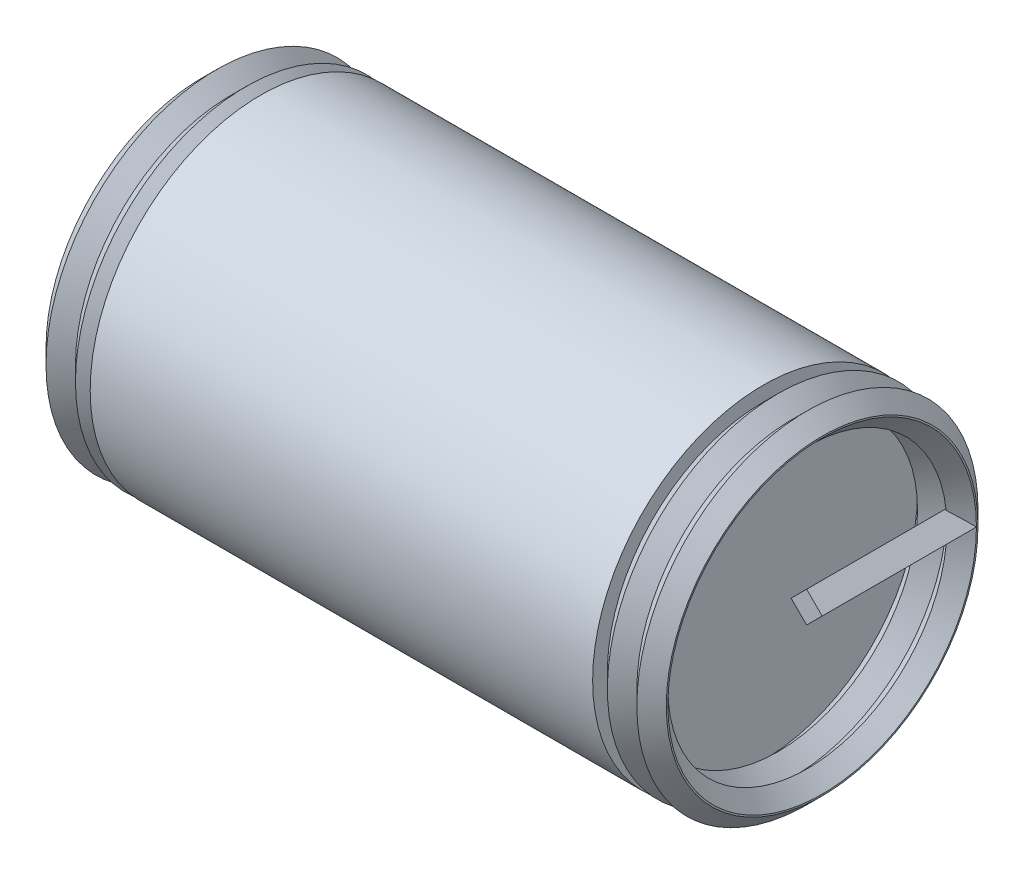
ISO-10303-21;
HEADER;
FILE_DESCRIPTION(('STEP AP214'),'2;1');
FILE_NAME('part.step','',(''),(''),'','','');
FILE_SCHEMA(('AUTOMOTIVE_DESIGN { 1 0 10303 214 1 1 1 1 }'));
ENDSEC;
DATA;
#1=APPLICATION_CONTEXT('core data for automotive mechanical design processes');
#2=APPLICATION_PROTOCOL_DEFINITION('international standard','automotive_design',2000,#1);
#3=PRODUCT_CONTEXT('',#1,'mechanical');
#4=PRODUCT('Part','Part','',(#3));
#5=PRODUCT_RELATED_PRODUCT_CATEGORY('part','',(#4));
#6=PRODUCT_DEFINITION_FORMATION('','',#4);
#7=PRODUCT_DEFINITION_CONTEXT('part definition',#1,'design');
#8=PRODUCT_DEFINITION('design','',#6,#7);
#9=PRODUCT_DEFINITION_SHAPE('','',#8);
#10=(LENGTH_UNIT() NAMED_UNIT(*) SI_UNIT(.MILLI.,.METRE.));
#11=(NAMED_UNIT(*) PLANE_ANGLE_UNIT() SI_UNIT($,.RADIAN.));
#12=(NAMED_UNIT(*) SI_UNIT($,.STERADIAN.) SOLID_ANGLE_UNIT());
#13=UNCERTAINTY_MEASURE_WITH_UNIT(LENGTH_MEASURE(1.E-05),#10,'distance_accuracy_value','');
#14=(GEOMETRIC_REPRESENTATION_CONTEXT(3) GLOBAL_UNCERTAINTY_ASSIGNED_CONTEXT((#13)) GLOBAL_UNIT_ASSIGNED_CONTEXT((#10,
#11,#12)) REPRESENTATION_CONTEXT('',''));
#15=CARTESIAN_POINT('',(0.,0.,0.));
#16=DIRECTION('',(0.,0.,1.));
#17=DIRECTION('',(1.,0.,0.));
#18=AXIS2_PLACEMENT_3D('',#15,#16,#17);
#19=CARTESIAN_POINT('',(0.2,0.,0.));
#20=DIRECTION('',(-0.707106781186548,0.707106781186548,0.));
#21=DIRECTION('',(-0.707106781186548,-0.707106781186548,0.));
#22=AXIS2_PLACEMENT_3D('',#19,#20,#21);
#23=PLANE('',#22);
#24=DIRECTION('',(-0.707106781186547,-0.707106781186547,0.));
#25=VECTOR('',#24,1.);
#26=CARTESIAN_POINT('',(0.4,0.2,0.));
#27=LINE('',#26,#25);
#28=CARTESIAN_POINT('',(0.4,0.2,0.));
#29=VERTEX_POINT('',#28);
#30=CARTESIAN_POINT('',(0.2,0.,0.));
#31=VERTEX_POINT('',#30);
#32=EDGE_CURVE('E132',#29,#31,#27,.T.);
#33=ORIENTED_EDGE('',*,*,#32,.T.);
#34=DIRECTION('',(0.,0.,1.));
#35=VECTOR('',#34,1.);
#36=CARTESIAN_POINT('',(0.2,0.,0.));
#37=LINE('',#36,#35);
#38=CARTESIAN_POINT('',(0.200000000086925,0.,1.81000000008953));
#39=VERTEX_POINT('',#38);
#40=EDGE_CURVE('E130',#39,#31,#37,.F.);
#41=ORIENTED_EDGE('',*,*,#40,.F.);
#42=CARTESIAN_POINT('',(0.200000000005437,2.31766187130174E-11,1.80999999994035));
#43=CARTESIAN_POINT('',(0.229574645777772,0.0295746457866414,1.8395320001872));
#44=CARTESIAN_POINT('',(0.259362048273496,0.0593620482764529,1.86861828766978));
#45=CARTESIAN_POINT('',(0.319362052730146,0.11936205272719,1.92589913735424));
#46=CARTESIAN_POINT('',(0.349574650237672,0.149574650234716,1.95409370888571));
#47=CARTESIAN_POINT('',(0.380000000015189,0.180000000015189,1.98184257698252));
#48=B_SPLINE_CURVE_WITH_KNOTS('',3,(#42,#43,#44,#45,#46,#47),.UNSPECIFIED.,.F.,.F.,(4,2,4),(0.,
0.153575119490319,0.307148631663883),.UNSPECIFIED.);
#49=CARTESIAN_POINT('',(0.380000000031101,0.1800000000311,1.98184257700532));
#50=VERTEX_POINT('',#49);
#51=EDGE_CURVE('E20',#39,#50,#48,.T.);
#52=ORIENTED_EDGE('',*,*,#51,.T.);
#53=CARTESIAN_POINT('',(0.379999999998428,0.179999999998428,1.98184257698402));
#54=CARTESIAN_POINT('',(0.383340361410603,0.183340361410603,1.97818515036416));
#55=CARTESIAN_POINT('',(0.386677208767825,0.186677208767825,1.97452134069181));
#56=CARTESIAN_POINT('',(0.393343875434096,0.193343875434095,1.96718095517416));
#57=CARTESIAN_POINT('',(0.396673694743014,0.196673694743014,1.96350437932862));
#58=CARTESIAN_POINT('',(0.399999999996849,0.199999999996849,1.95982142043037));
#59=B_SPLINE_CURVE_WITH_KNOTS('',3,(#53,#54,#55,#56,#57,#58),.UNSPECIFIED.,.F.,.F.,(4,2,4),(0.,
0.017922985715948,0.035845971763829),.UNSPECIFIED.);
#60=CARTESIAN_POINT('',(0.399999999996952,0.199999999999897,1.95982142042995));
#61=VERTEX_POINT('',#60);
#62=EDGE_CURVE('E128',#50,#61,#59,.T.);
#63=ORIENTED_EDGE('',*,*,#62,.T.);
#64=DIRECTION('',(0.,0.,1.));
#65=VECTOR('',#64,1.);
#66=CARTESIAN_POINT('',(0.4,0.2,0.));
#67=LINE('',#66,#65);
#68=EDGE_CURVE('E411',#29,#61,#67,.T.);
#69=ORIENTED_EDGE('',*,*,#68,.F.);
#70=EDGE_LOOP('',(#33,#41,#52,#63,#69));
#71=FACE_BOUND('',#70,.T.);
#72=ADVANCED_FACE('F16',(#71),#23,.T.);
#73=CARTESIAN_POINT('',(0.4,-0.2,0.));
#74=DIRECTION('',(-0.707106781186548,-0.707106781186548,0.));
#75=DIRECTION('',(0.707106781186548,-0.707106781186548,0.));
#76=AXIS2_PLACEMENT_3D('',#73,#74,#75);
#77=PLANE('',#76);
#78=DIRECTION('',(0.,0.,1.));
#79=VECTOR('',#78,1.);
#80=CARTESIAN_POINT('',(0.4,-0.2,0.));
#81=LINE('',#80,#79);
#82=CARTESIAN_POINT('',(0.399999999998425,-0.199999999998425,1.95982142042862));
#83=VERTEX_POINT('',#82);
#84=CARTESIAN_POINT('',(0.4,-0.2,0.));
#85=VERTEX_POINT('',#84);
#86=EDGE_CURVE('E231',#83,#85,#81,.F.);
#87=ORIENTED_EDGE('',*,*,#86,.F.);
#88=CARTESIAN_POINT('',(0.399999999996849,-0.199999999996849,1.95982142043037));
#89=CARTESIAN_POINT('',(0.396673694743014,-0.196673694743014,1.96350437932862));
#90=CARTESIAN_POINT('',(0.393343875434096,-0.193343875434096,1.96718095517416));
#91=CARTESIAN_POINT('',(0.386677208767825,-0.186677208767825,1.97452134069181));
#92=CARTESIAN_POINT('',(0.383340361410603,-0.183340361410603,1.97818515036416));
#93=CARTESIAN_POINT('',(0.379999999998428,-0.179999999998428,1.98184257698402));
#94=B_SPLINE_CURVE_WITH_KNOTS('',3,(#88,#89,#90,#91,#92,#93),.UNSPECIFIED.,.F.,.F.,(4,2,4),(0.,
0.017922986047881,0.0358459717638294),.UNSPECIFIED.);
#95=CARTESIAN_POINT('',(0.38000000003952,-0.18000000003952,1.98184257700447));
#96=VERTEX_POINT('',#95);
#97=EDGE_CURVE('E135',#83,#96,#94,.T.);
#98=ORIENTED_EDGE('',*,*,#97,.T.);
#99=CARTESIAN_POINT('',(0.380000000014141,-0.180000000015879,1.98184257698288));
#100=CARTESIAN_POINT('',(0.349574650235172,-0.149574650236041,1.95409370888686));
#101=CARTESIAN_POINT('',(0.31936205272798,-0.11936205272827,1.92589913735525));
#102=CARTESIAN_POINT('',(0.259362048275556,-0.0593620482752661,1.86861828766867));
#103=CARTESIAN_POINT('',(0.229574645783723,-0.029574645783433,1.83953200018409));
#104=CARTESIAN_POINT('',(0.200000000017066,-1.70661947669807E-11,1.80999999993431));
#105=B_SPLINE_CURVE_WITH_KNOTS('',3,(#99,#100,#101,#102,#103,#104),.UNSPECIFIED.,.F.,.F.,(4,2,
4),(0.,0.153573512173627,0.307148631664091),.UNSPECIFIED.);
#106=EDGE_CURVE('E123',#96,#39,#105,.T.);
#107=ORIENTED_EDGE('',*,*,#106,.T.);
#108=ORIENTED_EDGE('',*,*,#40,.T.);
#109=DIRECTION('',(0.707106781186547,-0.707106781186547,0.));
#110=VECTOR('',#109,1.);
#111=CARTESIAN_POINT('',(0.2,0.,0.));
#112=LINE('',#111,#110);
#113=EDGE_CURVE('E187',#31,#85,#112,.T.);
#114=ORIENTED_EDGE('',*,*,#113,.T.);
#115=EDGE_LOOP('',(#87,#98,#107,#108,#114));
#116=FACE_BOUND('',#115,.T.);
#117=ADVANCED_FACE('F139',(#116),#77,.T.);
#118=CARTESIAN_POINT('',(0.4,0.,0.));
#119=DIRECTION('',(0.,0.,1.));
#120=DIRECTION('',(1.,0.,0.));
#121=AXIS2_PLACEMENT_3D('',#118,#119,#120);
#122=PLANE('',#121);
#123=ORIENTED_EDGE('',*,*,#113,.F.);
#124=ORIENTED_EDGE('',*,*,#32,.F.);
#125=DIRECTION('',(-0.707106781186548,0.707106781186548,0.));
#126=VECTOR('',#125,1.);
#127=CARTESIAN_POINT('',(0.4,0.2,0.));
#128=LINE('',#127,#126);
#129=CARTESIAN_POINT('',(0.6,0.,0.));
#130=VERTEX_POINT('',#129);
#131=EDGE_CURVE('E186',#130,#29,#128,.T.);
#132=ORIENTED_EDGE('',*,*,#131,.F.);
#133=DIRECTION('',(0.707106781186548,0.707106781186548,0.));
#134=VECTOR('',#133,1.);
#135=CARTESIAN_POINT('',(0.6,0.,0.));
#136=LINE('',#135,#134);
#137=EDGE_CURVE('E400',#85,#130,#136,.T.);
#138=ORIENTED_EDGE('',*,*,#137,.F.);
#139=EDGE_LOOP('',(#123,#124,#132,#138));
#140=FACE_BOUND('',#139,.T.);
#141=ADVANCED_FACE('F160',(#140),#122,.F.);
#142=CARTESIAN_POINT('',(0.4,0.2,0.));
#143=DIRECTION('',(0.707106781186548,0.707106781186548,0.));
#144=DIRECTION('',(-0.707106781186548,0.707106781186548,0.));
#145=AXIS2_PLACEMENT_3D('',#142,#143,#144);
#146=PLANE('',#145);
#147=ORIENTED_EDGE('',*,*,#68,.T.);
#148=CARTESIAN_POINT('',(0.399999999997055,0.200000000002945,1.95982142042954));
#149=CARTESIAN_POINT('',(0.428703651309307,0.171296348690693,1.93392979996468));
#150=CARTESIAN_POINT('',(0.457222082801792,0.142777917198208,1.9076447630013));
#151=CARTESIAN_POINT('',(0.513888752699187,0.0861112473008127,1.85428762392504));
#152=CARTESIAN_POINT('',(0.542036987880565,0.0579630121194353,1.82721551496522));
#153=CARTESIAN_POINT('',(0.570000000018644,0.0299999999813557,1.79974998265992));
#154=B_SPLINE_CURVE_WITH_KNOTS('',3,(#148,#149,#150,#151,#152,#153),.UNSPECIFIED.,.F.,.F.,(4,2,
4),(0.,0.144421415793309,0.28884408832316),.UNSPECIFIED.);
#155=CARTESIAN_POINT('',(0.570000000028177,0.0299999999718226,1.79974998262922));
#156=VERTEX_POINT('',#155);
#157=EDGE_CURVE('E176',#61,#156,#154,.T.);
#158=ORIENTED_EDGE('',*,*,#157,.T.);
#159=CARTESIAN_POINT('',(0.570000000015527,0.0299999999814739,1.7997499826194));
#160=CARTESIAN_POINT('',(0.57498595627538,0.0250140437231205,1.80481950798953));
#161=CARTESIAN_POINT('',(0.579978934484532,0.020021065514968,1.80987510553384));
#162=CARTESIAN_POINT('',(0.58997893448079,0.0100210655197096,1.81995844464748));
#163=CARTESIAN_POINT('',(0.594985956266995,0.00501404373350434,1.82498618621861));
#164=CARTESIAN_POINT('',(0.600000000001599,-1.59941669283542E-12,1.82999999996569));
#165=B_SPLINE_CURVE_WITH_KNOTS('',3,(#159,#160,#161,#162,#163,#164),.UNSPECIFIED.,.F.,.F.,(4,2,
4),(0.,0.0260531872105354,0.0521063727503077),.UNSPECIFIED.);
#166=CARTESIAN_POINT('',(0.599999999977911,1.35304092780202E-12,1.82999999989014));
#167=VERTEX_POINT('',#166);
#168=EDGE_CURVE('E181',#156,#167,#165,.T.);
#169=ORIENTED_EDGE('',*,*,#168,.T.);
#170=DIRECTION('',(0.,0.,1.));
#171=VECTOR('',#170,1.);
#172=CARTESIAN_POINT('',(0.6,0.,0.));
#173=LINE('',#172,#171);
#174=EDGE_CURVE('E397',#130,#167,#173,.T.);
#175=ORIENTED_EDGE('',*,*,#174,.F.);
#176=ORIENTED_EDGE('',*,*,#131,.T.);
#177=EDGE_LOOP('',(#147,#158,#169,#175,#176));
#178=FACE_BOUND('',#177,.T.);
#179=ADVANCED_FACE('F165',(#178),#146,.T.);
#180=CARTESIAN_POINT('',(8.,0.,0.));
#181=DIRECTION('',(0.707106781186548,0.707106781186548,0.));
#182=DIRECTION('',(-0.707106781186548,0.707106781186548,0.));
#183=AXIS2_PLACEMENT_3D('',#180,#181,#182);
#184=PLANE('',#183);
#185=DIRECTION('',(0.707106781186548,-0.707106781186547,0.));
#186=VECTOR('',#185,1.);
#187=CARTESIAN_POINT('',(7.8,0.2,0.));
#188=LINE('',#187,#186);
#189=CARTESIAN_POINT('',(7.8,0.2,0.));
#190=VERTEX_POINT('',#189);
#191=CARTESIAN_POINT('',(8.,0.,0.));
#192=VERTEX_POINT('',#191);
#193=EDGE_CURVE('E390',#190,#192,#188,.T.);
#194=ORIENTED_EDGE('',*,*,#193,.T.);
#195=DIRECTION('',(0.,0.,1.));
#196=VECTOR('',#195,1.);
#197=CARTESIAN_POINT('',(8.,0.,0.));
#198=LINE('',#197,#196);
#199=CARTESIAN_POINT('',(7.99999999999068,-9.32247447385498E-12,-1.98999999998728));
#200=VERTEX_POINT('',#199);
#201=EDGE_CURVE('E295',#200,#192,#198,.T.);
#202=ORIENTED_EDGE('',*,*,#201,.F.);
#203=CARTESIAN_POINT('',(7.99999999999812,1.87948845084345E-12,-1.98999999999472));
#204=CARTESIAN_POINT('',(7.98387979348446,0.0161202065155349,-1.97387955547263));
#205=CARTESIAN_POINT('',(7.96782460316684,0.0321753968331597,-1.95762872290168));
#206=CARTESIAN_POINT('',(7.9358562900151,0.0641437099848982,-1.92485758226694));
#207=CARTESIAN_POINT('',(7.91994314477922,0.0800568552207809,-1.90833731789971));
#208=CARTESIAN_POINT('',(7.88826545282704,0.111734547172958,-1.87501310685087));
#209=CARTESIAN_POINT('',(7.87250090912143,0.12749909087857,-1.85820915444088));
#210=CARTESIAN_POINT('',(7.84112910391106,0.158870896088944,-1.82430288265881));
#211=CARTESIAN_POINT('',(7.82552186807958,0.174478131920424,-1.80720051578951));
#212=CARTESIAN_POINT('',(7.81000000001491,0.189999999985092,-1.78994413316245));
#213=B_SPLINE_CURVE_WITH_KNOTS('',3,(#203,#204,#205,#206,#207,#208,#209,#210,#211,#212),
.UNSPECIFIED.,.F.,.F.,(4,2,2,2,4),(0.,0.0837633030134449,0.167513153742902,0.25126469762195,
0.335029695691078),.UNSPECIFIED.);
#214=CARTESIAN_POINT('',(7.8099999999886,0.190000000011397,-1.78994413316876));
#215=VERTEX_POINT('',#214);
#216=EDGE_CURVE('E528',#200,#215,#213,.T.);
#217=ORIENTED_EDGE('',*,*,#216,.T.);
#218=CARTESIAN_POINT('',(7.80999999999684,0.190000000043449,-1.78994413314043));
#219=CARTESIAN_POINT('',(7.80833452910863,0.191665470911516,-1.7914421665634));
#220=CARTESIAN_POINT('',(7.80666846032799,0.19333153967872,-1.79293886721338));
#221=CARTESIAN_POINT('',(7.80333512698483,0.19666487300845,-1.79592960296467));
#222=CARTESIAN_POINT('',(7.80166786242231,0.198332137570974,-1.797423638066));
#223=CARTESIAN_POINT('',(7.79999999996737,0.200000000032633,-1.79891634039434));
#224=B_SPLINE_CURVE_WITH_KNOTS('',3,(#218,#219,#220,#221,#222,#223),.UNSPECIFIED.,.F.,.F.,(4,2,
4),(0.,0.00837407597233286,0.0167481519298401),.UNSPECIFIED.);
#225=CARTESIAN_POINT('',(7.79999999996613,0.199999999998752,-1.79891634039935));
#226=VERTEX_POINT('',#225);
#227=EDGE_CURVE('E232',#215,#226,#224,.T.);
#228=ORIENTED_EDGE('',*,*,#227,.T.);
#229=DIRECTION('',(0.,0.,1.));
#230=VECTOR('',#229,1.);
#231=CARTESIAN_POINT('',(7.8,0.2,0.));
#232=LINE('',#231,#230);
#233=EDGE_CURVE('E382',#190,#226,#232,.F.);
#234=ORIENTED_EDGE('',*,*,#233,.F.);
#235=EDGE_LOOP('',(#194,#202,#217,#228,#234));
#236=FACE_BOUND('',#235,.T.);
#237=ADVANCED_FACE('F170',(#236),#184,.T.);
#238=CARTESIAN_POINT('',(0.6,0.,0.));
#239=DIRECTION('',(0.707106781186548,-0.707106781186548,0.));
#240=DIRECTION('',(0.707106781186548,0.707106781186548,0.));
#241=AXIS2_PLACEMENT_3D('',#238,#239,#240);
#242=PLANE('',#241);
#243=ORIENTED_EDGE('',*,*,#137,.T.);
#244=ORIENTED_EDGE('',*,*,#174,.T.);
#245=CARTESIAN_POINT('',(0.570000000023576,-0.0299999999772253,1.79974998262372));
#246=CARTESIAN_POINT('',(0.574985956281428,-0.0250140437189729,1.80481950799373));
#247=CARTESIAN_POINT('',(0.579978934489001,-0.0200210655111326,1.80987510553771));
#248=CARTESIAN_POINT('',(0.589978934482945,-0.0100210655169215,1.81995844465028));
#249=CARTESIAN_POINT('',(0.594985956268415,-0.00501404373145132,1.82498618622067));
#250=CARTESIAN_POINT('',(0.600000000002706,2.70607760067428E-12,1.8299999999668));
#251=B_SPLINE_CURVE_WITH_KNOTS('',3,(#245,#246,#247,#248,#249,#250),.UNSPECIFIED.,.F.,.F.,(4,2,
4),(0.,0.0260531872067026,0.052106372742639),.UNSPECIFIED.);
#252=CARTESIAN_POINT('',(0.570000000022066,-0.0299999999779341,1.79974998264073));
#253=VERTEX_POINT('',#252);
#254=EDGE_CURVE('E201',#253,#167,#251,.T.);
#255=ORIENTED_EDGE('',*,*,#254,.F.);
#256=CARTESIAN_POINT('',(0.570000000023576,-0.0299999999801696,1.79974998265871));
#257=CARTESIAN_POINT('',(0.542036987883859,-0.0579630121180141,1.8272155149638));
#258=CARTESIAN_POINT('',(0.513888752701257,-0.0861112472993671,1.85428762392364));
#259=CARTESIAN_POINT('',(0.457222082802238,-0.142777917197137,1.90764476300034));
#260=CARTESIAN_POINT('',(0.428703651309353,-0.171296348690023,1.93392979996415));
#261=CARTESIAN_POINT('',(0.399999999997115,-0.200000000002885,1.95982142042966));
#262=B_SPLINE_CURVE_WITH_KNOTS('',3,(#256,#257,#258,#259,#260,#261),.UNSPECIFIED.,.F.,.F.,(4,2,
4),(0.,0.144422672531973,0.288844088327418),.UNSPECIFIED.);
#263=EDGE_CURVE('E224',#253,#83,#262,.T.);
#264=ORIENTED_EDGE('',*,*,#263,.T.);
#265=ORIENTED_EDGE('',*,*,#86,.T.);
#266=EDGE_LOOP('',(#243,#244,#255,#264,#265));
#267=FACE_BOUND('',#266,.T.);
#268=ADVANCED_FACE('F215',(#267),#242,.T.);
#269=CARTESIAN_POINT('',(0.76,0.,0.));
#270=DIRECTION('',(-1.,0.,0.));
#271=DIRECTION('',(0.,0.,1.));
#272=AXIS2_PLACEMENT_3D('',#269,#270,#271);
#273=PLANE('',#272);
#274=CARTESIAN_POINT('',(0.759999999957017,0.,0.));
#275=DIRECTION('',(1.,0.,0.));
#276=DIRECTION('',(0.,0.,-1.));
#277=AXIS2_PLACEMENT_3D('',#274,#275,#276);
#278=CIRCLE('',#277,1.98999999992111);
#279=CARTESIAN_POINT('',(0.759999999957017,0.,-1.98999999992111));
#280=VERTEX_POINT('',#279);
#281=EDGE_CURVE('E208',#280,#280,#278,.T.);
#282=ORIENTED_EDGE('',*,*,#281,.F.);
#283=EDGE_LOOP('',(#282));
#284=FACE_BOUND('',#283,.T.);
#285=ADVANCED_FACE('F219',(#284),#273,.T.);
#286=CARTESIAN_POINT('',(7.8,-0.2,0.));
#287=DIRECTION('',(0.707106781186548,-0.707106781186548,0.));
#288=DIRECTION('',(0.707106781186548,0.707106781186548,0.));
#289=AXIS2_PLACEMENT_3D('',#286,#287,#288);
#290=PLANE('',#289);
#291=DIRECTION('',(0.,0.,1.));
#292=VECTOR('',#291,1.);
#293=CARTESIAN_POINT('',(7.8,-0.2,0.));
#294=LINE('',#293,#292);
#295=CARTESIAN_POINT('',(7.79999999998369,-0.200000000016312,-1.79891634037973));
#296=VERTEX_POINT('',#295);
#297=CARTESIAN_POINT('',(7.8,-0.2,0.));
#298=VERTEX_POINT('',#297);
#299=EDGE_CURVE('E279',#296,#298,#294,.T.);
#300=ORIENTED_EDGE('',*,*,#299,.F.);
#301=CARTESIAN_POINT('',(7.7999999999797,-0.200000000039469,-1.79891634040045));
#302=CARTESIAN_POINT('',(7.80166786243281,-0.19833213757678,-1.79742363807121));
#303=CARTESIAN_POINT('',(7.80333512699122,-0.196664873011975,-1.79592960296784));
#304=CARTESIAN_POINT('',(7.80666846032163,-0.193331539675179,-1.79293886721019));
#305=CARTESIAN_POINT('',(7.80833452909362,-0.191665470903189,-1.79144216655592));
#306=CARTESIAN_POINT('',(7.80999999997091,-0.190000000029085,-1.78994413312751));
#307=B_SPLINE_CURVE_WITH_KNOTS('',3,(#301,#302,#303,#304,#305,#306),.UNSPECIFIED.,.F.,.F.,(4,2,
4),(0.,0.00837407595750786,0.0167481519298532),.UNSPECIFIED.);
#308=CARTESIAN_POINT('',(7.81000000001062,-0.18999999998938,-1.7899441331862));
#309=VERTEX_POINT('',#308);
#310=EDGE_CURVE('E288',#296,#309,#307,.T.);
#311=ORIENTED_EDGE('',*,*,#310,.T.);
#312=CARTESIAN_POINT('',(7.81000000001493,-0.189999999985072,-1.78994413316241));
#313=CARTESIAN_POINT('',(7.82552186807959,-0.174478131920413,-1.80720051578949));
#314=CARTESIAN_POINT('',(7.84112910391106,-0.158870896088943,-1.8243028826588));
#315=CARTESIAN_POINT('',(7.87250090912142,-0.127499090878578,-1.85820915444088));
#316=CARTESIAN_POINT('',(7.88826545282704,-0.111734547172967,-1.87501310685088));
#317=CARTESIAN_POINT('',(7.91994314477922,-0.0800568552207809,-1.9083373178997));
#318=CARTESIAN_POINT('',(7.93585629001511,-0.064143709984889,-1.9248575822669));
#319=CARTESIAN_POINT('',(7.96782460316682,-0.0321753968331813,-1.95762872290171));
#320=CARTESIAN_POINT('',(7.9838797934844,-0.0161202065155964,-1.97387955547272));
#321=CARTESIAN_POINT('',(7.99999999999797,-2.03499376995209E-12,-1.989999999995));
#322=B_SPLINE_CURVE_WITH_KNOTS('',3,(#312,#313,#314,#315,#316,#317,#318,#319,#320,#321),
.UNSPECIFIED.,.F.,.F.,(4,2,2,2,4),(0.,0.083764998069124,0.167516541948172,0.251266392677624,
0.335029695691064),.UNSPECIFIED.);
#323=EDGE_CURVE('E233',#309,#200,#322,.T.);
#324=ORIENTED_EDGE('',*,*,#323,.T.);
#325=ORIENTED_EDGE('',*,*,#201,.T.);
#326=DIRECTION('',(-0.707106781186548,-0.707106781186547,0.));
#327=VECTOR('',#326,1.);
#328=CARTESIAN_POINT('',(8.,0.,0.));
#329=LINE('',#328,#327);
#330=EDGE_CURVE('E294',#192,#298,#329,.T.);
#331=ORIENTED_EDGE('',*,*,#330,.T.);
#332=EDGE_LOOP('',(#300,#311,#324,#325,#331));
#333=FACE_BOUND('',#332,.T.);
#334=ADVANCED_FACE('F296',(#333),#290,.T.);
#335=CARTESIAN_POINT('',(7.8,0.,0.));
#336=DIRECTION('',(0.,0.,-1.));
#337=DIRECTION('',(0.,1.,0.));
#338=AXIS2_PLACEMENT_3D('',#335,#336,#337);
#339=PLANE('',#338);
#340=DIRECTION('',(-0.707106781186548,-0.707106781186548,0.));
#341=VECTOR('',#340,1.);
#342=CARTESIAN_POINT('',(7.8,0.2,0.));
#343=LINE('',#342,#341);
#344=CARTESIAN_POINT('',(7.6,0.,0.));
#345=VERTEX_POINT('',#344);
#346=EDGE_CURVE('E379',#345,#190,#343,.F.);
#347=ORIENTED_EDGE('',*,*,#346,.F.);
#348=DIRECTION('',(0.707106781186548,-0.707106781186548,0.));
#349=VECTOR('',#348,1.);
#350=CARTESIAN_POINT('',(7.6,0.,0.));
#351=LINE('',#350,#349);
#352=EDGE_CURVE('E374',#298,#345,#351,.F.);
#353=ORIENTED_EDGE('',*,*,#352,.F.);
#354=ORIENTED_EDGE('',*,*,#330,.F.);
#355=ORIENTED_EDGE('',*,*,#193,.F.);
#356=EDGE_LOOP('',(#347,#353,#354,#355));
#357=FACE_BOUND('',#356,.T.);
#358=ADVANCED_FACE('F300',(#357),#339,.F.);
#359=CARTESIAN_POINT('',(7.8,0.2,0.));
#360=DIRECTION('',(-0.707106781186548,0.707106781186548,0.));
#361=DIRECTION('',(-0.707106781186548,-0.707106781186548,0.));
#362=AXIS2_PLACEMENT_3D('',#359,#360,#361);
#363=PLANE('',#362);
#364=ORIENTED_EDGE('',*,*,#233,.T.);
#365=CARTESIAN_POINT('',(7.7999999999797,0.199999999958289,-1.79891634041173));
#366=CARTESIAN_POINT('',(7.78528301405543,0.185283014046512,-1.81535972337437));
#367=CARTESIAN_POINT('',(7.77048903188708,0.170489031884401,-1.83166453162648));
#368=CARTESIAN_POINT('',(7.74075809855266,0.140758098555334,-1.86400497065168));
#369=CARTESIAN_POINT('',(7.72582116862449,0.125821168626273,-1.88004064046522));
#370=CARTESIAN_POINT('',(7.6808048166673,0.0808048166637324,-1.92776429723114));
#371=CARTESIAN_POINT('',(7.65052098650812,0.0505209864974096,-1.95906764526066));
#372=CARTESIAN_POINT('',(7.61999999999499,0.0199999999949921,-1.98989949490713));
#373=B_SPLINE_CURVE_WITH_KNOTS('',3,(#365,#366,#367,#368,#369,#370,#371,#372),.UNSPECIFIED.,.F.,
.F.,(4,2,2,4),(0.,0.0795729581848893,0.159134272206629,0.318263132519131),.UNSPECIFIED.);
#374=CARTESIAN_POINT('',(7.62000000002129,0.0200000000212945,-1.98989949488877));
#375=VERTEX_POINT('',#374);
#376=EDGE_CURVE('E209',#226,#375,#373,.T.);
#377=ORIENTED_EDGE('',*,*,#376,.T.);
#378=CARTESIAN_POINT('',(7.62000000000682,0.0200000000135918,-1.98989949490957));
#379=CARTESIAN_POINT('',(7.61666112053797,0.0166611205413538,-1.98659406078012));
#380=CARTESIAN_POINT('',(7.61332501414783,0.0133250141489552,-1.98328305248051));
#381=CARTESIAN_POINT('',(7.60665834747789,0.0066583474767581,-1.97664988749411));
#382=CARTESIAN_POINT('',(7.60332778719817,0.00332778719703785,-1.97332773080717));
#383=CARTESIAN_POINT('',(7.59999999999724,-2.76459286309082E-12,-1.9699999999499));
#384=B_SPLINE_CURVE_WITH_KNOTS('',3,(#378,#379,#380,#381,#382,#383),.UNSPECIFIED.,.F.,.F.,(4,2,
4),(0.,0.0172915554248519,0.0345831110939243),.UNSPECIFIED.);
#385=CARTESIAN_POINT('',(7.59999999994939,0.,-1.96999999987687));
#386=VERTEX_POINT('',#385);
#387=EDGE_CURVE('E255',#375,#386,#384,.T.);
#388=ORIENTED_EDGE('',*,*,#387,.T.);
#389=DIRECTION('',(0.,0.,1.));
#390=VECTOR('',#389,1.);
#391=CARTESIAN_POINT('',(7.6,0.,0.));
#392=LINE('',#391,#390);
#393=EDGE_CURVE('E273',#345,#386,#392,.F.);
#394=ORIENTED_EDGE('',*,*,#393,.F.);
#395=ORIENTED_EDGE('',*,*,#346,.T.);
#396=EDGE_LOOP('',(#364,#377,#388,#394,#395));
#397=FACE_BOUND('',#396,.T.);
#398=ADVANCED_FACE('F304',(#397),#363,.T.);
#399=CARTESIAN_POINT('',(7.24,0.,0.));
#400=DIRECTION('',(1.,0.,0.));
#401=DIRECTION('',(0.,1.,0.));
#402=AXIS2_PLACEMENT_3D('',#399,#400,#401);
#403=PLANE('',#402);
#404=CARTESIAN_POINT('',(7.23999999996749,0.,0.));
#405=DIRECTION('',(-1.,0.,0.));
#406=DIRECTION('',(0.,0.,1.));
#407=AXIS2_PLACEMENT_3D('',#404,#405,#406);
#408=CIRCLE('',#407,1.9900000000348);
#409=CARTESIAN_POINT('',(7.23999999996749,0.,1.9900000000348));
#410=VERTEX_POINT('',#409);
#411=EDGE_CURVE('E271',#410,#410,#408,.T.);
#412=ORIENTED_EDGE('',*,*,#411,.F.);
#413=EDGE_LOOP('',(#412));
#414=FACE_BOUND('',#413,.T.);
#415=ADVANCED_FACE('F194',(#414),#403,.T.);
#416=CARTESIAN_POINT('',(0.569999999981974,0.,0.));
#417=DIRECTION('',(1.,0.,0.));
#418=DIRECTION('',(0.,0.,-1.));
#419=AXIS2_PLACEMENT_3D('',#416,#417,#418);
#420=CONICAL_SURFACE('',#419,1.79999999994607,0.785398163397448);
#421=ORIENTED_EDGE('',*,*,#281,.T.);
#422=EDGE_LOOP('',(#421));
#423=FACE_BOUND('',#422,.T.);
#424=ORIENTED_EDGE('',*,*,#168,.F.);
#425=CARTESIAN_POINT('',(0.570000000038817,0.,0.));
#426=DIRECTION('',(-1.,0.,0.));
#427=DIRECTION('',(0.,0.,-1.));
#428=AXIS2_PLACEMENT_3D('',#425,#426,#427);
#429=CIRCLE('',#428,1.80000000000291);
#430=EDGE_CURVE('E268',#253,#156,#429,.F.);
#431=ORIENTED_EDGE('',*,*,#430,.F.);
#432=ORIENTED_EDGE('',*,*,#254,.T.);
#433=EDGE_LOOP('',(#424,#431,#432));
#434=FACE_BOUND('',#433,.T.);
#435=ADVANCED_FACE('F188',(#423,#434),#420,.F.);
#436=CARTESIAN_POINT('',(7.6,0.,0.));
#437=DIRECTION('',(-0.707106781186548,-0.707106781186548,0.));
#438=DIRECTION('',(0.707106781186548,-0.707106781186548,0.));
#439=AXIS2_PLACEMENT_3D('',#436,#437,#438);
#440=PLANE('',#439);
#441=ORIENTED_EDGE('',*,*,#352,.T.);
#442=ORIENTED_EDGE('',*,*,#393,.T.);
#443=CARTESIAN_POINT('',(7.62000000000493,-0.0200000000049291,-1.98989949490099));
#444=CARTESIAN_POINT('',(7.6166611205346,-0.0166611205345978,-1.98659406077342));
#445=CARTESIAN_POINT('',(7.61332501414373,-0.0133250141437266,-1.98328305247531));
#446=CARTESIAN_POINT('',(7.60665834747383,-0.00665834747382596,-1.97664988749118));
#447=CARTESIAN_POINT('',(7.60332778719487,-0.00332778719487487,-1.973327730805));
#448=CARTESIAN_POINT('',(7.59999999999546,4.53784623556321E-12,-1.96999999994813));
#449=B_SPLINE_CURVE_WITH_KNOTS('',3,(#443,#444,#445,#446,#447,#448),.UNSPECIFIED.,.F.,.F.,(4,2,
4),(0.,0.0172915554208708,0.0345831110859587),.UNSPECIFIED.);
#450=CARTESIAN_POINT('',(7.6199999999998,-0.0199999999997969,-1.98989949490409));
#451=VERTEX_POINT('',#450);
#452=EDGE_CURVE('E260',#451,#386,#449,.T.);
#453=ORIENTED_EDGE('',*,*,#452,.F.);
#454=CARTESIAN_POINT('',(7.61999999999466,-0.0199999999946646,-1.9898994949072));
#455=CARTESIAN_POINT('',(7.65052098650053,-0.0505209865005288,-1.9590676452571));
#456=CARTESIAN_POINT('',(7.68080481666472,-0.0808048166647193,-1.92776429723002));
#457=CARTESIAN_POINT('',(7.72582116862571,-0.125821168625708,-1.88004064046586));
#458=CARTESIAN_POINT('',(7.74075809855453,-0.140758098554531,-1.86400497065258));
#459=CARTESIAN_POINT('',(7.77048903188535,-0.170489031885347,-1.83166453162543));
#460=CARTESIAN_POINT('',(7.78528301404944,-0.185283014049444,-1.81535972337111));
#461=CARTESIAN_POINT('',(7.79999999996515,-0.199999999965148,-1.79891634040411));
#462=B_SPLINE_CURVE_WITH_KNOTS('',3,(#454,#455,#456,#457,#458,#459,#460,#461),.UNSPECIFIED.,.F.,
.F.,(4,2,2,4),(0.,0.159128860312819,0.238690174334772,0.318263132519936),.UNSPECIFIED.);
#463=EDGE_CURVE('E274',#451,#296,#462,.T.);
#464=ORIENTED_EDGE('',*,*,#463,.T.);
#465=ORIENTED_EDGE('',*,*,#299,.T.);
#466=EDGE_LOOP('',(#441,#442,#453,#464,#465));
#467=FACE_BOUND('',#466,.T.);
#468=ADVANCED_FACE('F193',(#467),#440,.T.);
#469=CARTESIAN_POINT('',(7.42999999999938,0.,0.));
#470=DIRECTION('',(-1.,0.,0.));
#471=DIRECTION('',(0.,0.,1.));
#472=AXIS2_PLACEMENT_3D('',#469,#470,#471);
#473=CONICAL_SURFACE('',#472,1.80000000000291,0.785398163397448);
#474=CARTESIAN_POINT('',(7.42999999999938,0.,0.));
#475=DIRECTION('',(1.,0.,0.));
#476=DIRECTION('',(0.,0.,-1.));
#477=AXIS2_PLACEMENT_3D('',#474,#475,#476);
#478=CIRCLE('',#477,1.80000000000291);
#479=CARTESIAN_POINT('',(7.42999999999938,0.,-1.80000000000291));
#480=VERTEX_POINT('',#479);
#481=EDGE_CURVE('E267',#480,#480,#478,.F.);
#482=ORIENTED_EDGE('',*,*,#481,.F.);
#483=EDGE_LOOP('',(#482));
#484=FACE_BOUND('',#483,.T.);
#485=ORIENTED_EDGE('',*,*,#411,.T.);
#486=EDGE_LOOP('',(#485));
#487=FACE_BOUND('',#486,.T.);
#488=ADVANCED_FACE('F246',(#484,#487),#473,.F.);
#489=CARTESIAN_POINT('',(0.570000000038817,0.,0.));
#490=DIRECTION('',(-1.,0.,0.));
#491=DIRECTION('',(0.,0.,1.));
#492=AXIS2_PLACEMENT_3D('',#489,#490,#491);
#493=CONICAL_SURFACE('',#492,1.80000000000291,0.78539816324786);
#494=CARTESIAN_POINT('',(0.380000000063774,0.,0.));
#495=DIRECTION('',(1.,0.,0.));
#496=DIRECTION('',(0.,0.,-1.));
#497=AXIS2_PLACEMENT_3D('',#494,#495,#496);
#498=CIRCLE('',#497,1.9900000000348);
#499=EDGE_CURVE('E125',#96,#50,#498,.T.);
#500=ORIENTED_EDGE('',*,*,#499,.F.);
#501=ORIENTED_EDGE('',*,*,#97,.F.);
#502=ORIENTED_EDGE('',*,*,#263,.F.);
#503=ORIENTED_EDGE('',*,*,#430,.T.);
#504=ORIENTED_EDGE('',*,*,#157,.F.);
#505=ORIENTED_EDGE('',*,*,#62,.F.);
#506=EDGE_LOOP('',(#500,#501,#502,#503,#504,#505));
#507=FACE_BOUND('',#506,.T.);
#508=ADVANCED_FACE('F242',(#507),#493,.F.);
#509=CARTESIAN_POINT('',(7.42999999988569,0.,0.));
#510=DIRECTION('',(1.,0.,0.));
#511=DIRECTION('',(0.,1.,0.));
#512=AXIS2_PLACEMENT_3D('',#509,#510,#511);
#513=CONICAL_SURFACE('',#512,1.79999999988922,0.78539816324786);
#514=ORIENTED_EDGE('',*,*,#452,.T.);
#515=ORIENTED_EDGE('',*,*,#387,.F.);
#516=CARTESIAN_POINT('',(7.62000000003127,0.,0.));
#517=DIRECTION('',(-1.,0.,0.));
#518=DIRECTION('',(0.,0.,-1.));
#519=AXIS2_PLACEMENT_3D('',#516,#517,#518);
#520=CIRCLE('',#519,1.98999999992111);
#521=EDGE_CURVE('E361',#451,#375,#520,.T.);
#522=ORIENTED_EDGE('',*,*,#521,.F.);
#523=EDGE_LOOP('',(#514,#515,#522));
#524=FACE_BOUND('',#523,.T.);
#525=ORIENTED_EDGE('',*,*,#481,.T.);
#526=EDGE_LOOP('',(#525));
#527=FACE_BOUND('',#526,.T.);
#528=ADVANCED_FACE('F245',(#524,#527),#513,.F.);
#529=CARTESIAN_POINT('',(0.1899999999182,0.,0.));
#530=DIRECTION('',(1.,0.,0.));
#531=DIRECTION('',(0.,0.,-1.));
#532=AXIS2_PLACEMENT_3D('',#529,#530,#531);
#533=CONICAL_SURFACE('',#532,1.79999999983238,0.785398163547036);
#534=CARTESIAN_POINT('',(0.189999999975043,0.,0.));
#535=DIRECTION('',(-1.,0.,0.));
#536=DIRECTION('',(0.,0.,-1.));
#537=AXIS2_PLACEMENT_3D('',#534,#535,#536);
#538=CIRCLE('',#537,1.80000000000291);
#539=CARTESIAN_POINT('',(0.189999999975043,0.,-1.80000000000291));
#540=VERTEX_POINT('',#539);
#541=EDGE_CURVE('E355',#540,#540,#538,.F.);
#542=ORIENTED_EDGE('',*,*,#541,.F.);
#543=EDGE_LOOP('',(#542));
#544=FACE_BOUND('',#543,.T.);
#545=ORIENTED_EDGE('',*,*,#106,.F.);
#546=ORIENTED_EDGE('',*,*,#499,.T.);
#547=ORIENTED_EDGE('',*,*,#51,.F.);
#548=EDGE_LOOP('',(#545,#546,#547));
#549=FACE_BOUND('',#548,.T.);
#550=ADVANCED_FACE('F121',(#544,#549),#533,.F.);
#551=CARTESIAN_POINT('',(7.81000000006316,0.,0.));
#552=DIRECTION('',(-1.,0.,0.));
#553=DIRECTION('',(0.,0.,1.));
#554=AXIS2_PLACEMENT_3D('',#551,#552,#553);
#555=CONICAL_SURFACE('',#554,1.79999999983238,0.785398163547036);
#556=ORIENTED_EDGE('',*,*,#521,.T.);
#557=ORIENTED_EDGE('',*,*,#376,.F.);
#558=ORIENTED_EDGE('',*,*,#227,.F.);
#559=CARTESIAN_POINT('',(7.81000000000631,0.,0.));
#560=DIRECTION('',(1.,0.,0.));
#561=DIRECTION('',(0.,0.,-1.));
#562=AXIS2_PLACEMENT_3D('',#559,#560,#561);
#563=CIRCLE('',#562,1.80000000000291);
#564=EDGE_CURVE('E352',#309,#215,#563,.F.);
#565=ORIENTED_EDGE('',*,*,#564,.F.);
#566=ORIENTED_EDGE('',*,*,#310,.F.);
#567=ORIENTED_EDGE('',*,*,#463,.F.);
#568=EDGE_LOOP('',(#556,#557,#558,#565,#566,#567));
#569=FACE_BOUND('',#568,.T.);
#570=ADVANCED_FACE('F280',(#569),#555,.F.);
#571=CARTESIAN_POINT('',(0.190000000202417,0.,0.));
#572=DIRECTION('',(-1.,0.,0.));
#573=DIRECTION('',(0.,0.,1.));
#574=AXIS2_PLACEMENT_3D('',#571,#572,#573);
#575=CONICAL_SURFACE('',#574,1.79999999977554,0.785398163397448);
#576=CARTESIAN_POINT('',(5.68432833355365E-11,0.,0.));
#577=DIRECTION('',(-1.,0.,0.));
#578=DIRECTION('',(0.,0.,1.));
#579=AXIS2_PLACEMENT_3D('',#576,#577,#578);
#580=CIRCLE('',#579,1.98999999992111);
#581=CARTESIAN_POINT('',(5.68431484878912E-11,0.,1.98999999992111));
#582=VERTEX_POINT('',#581);
#583=EDGE_CURVE('E269',#582,#582,#580,.F.);
#584=ORIENTED_EDGE('',*,*,#583,.F.);
#585=EDGE_LOOP('',(#584));
#586=FACE_BOUND('',#585,.T.);
#587=ORIENTED_EDGE('',*,*,#541,.T.);
#588=EDGE_LOOP('',(#587));
#589=FACE_BOUND('',#588,.T.);
#590=ADVANCED_FACE('F284',(#586,#589),#575,.F.);
#591=CARTESIAN_POINT('',(7.80999999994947,0.,0.));
#592=DIRECTION('',(1.,0.,0.));
#593=DIRECTION('',(0.,1.,0.));
#594=AXIS2_PLACEMENT_3D('',#591,#592,#593);
#595=CONICAL_SURFACE('',#594,1.79999999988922,0.785398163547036);
#596=ORIENTED_EDGE('',*,*,#323,.F.);
#597=ORIENTED_EDGE('',*,*,#564,.T.);
#598=ORIENTED_EDGE('',*,*,#216,.F.);
#599=CARTESIAN_POINT('',(7.99999999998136,0.,0.));
#600=DIRECTION('',(1.,0.,0.));
#601=DIRECTION('',(0.,1.,0.));
#602=AXIS2_PLACEMENT_3D('',#599,#600,#601);
#603=CIRCLE('',#602,1.98999999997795);
#604=EDGE_CURVE('E347',#200,#200,#603,.F.);
#605=ORIENTED_EDGE('',*,*,#604,.F.);
#606=EDGE_LOOP('',(#596,#597,#598,#605));
#607=FACE_BOUND('',#606,.T.);
#608=ADVANCED_FACE('F523',(#607),#595,.F.);
#609=CARTESIAN_POINT('',(0.,0.,0.));
#610=DIRECTION('',(-1.,0.,0.));
#611=DIRECTION('',(0.,0.,1.));
#612=AXIS2_PLACEMENT_3D('',#609,#610,#611);
#613=PLANE('',#612);
#614=CARTESIAN_POINT('',(5.68433917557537E-11,0.,0.));
#615=DIRECTION('',(1.,0.,0.));
#616=DIRECTION('',(0.,0.,-1.));
#617=AXIS2_PLACEMENT_3D('',#614,#615,#616);
#618=CIRCLE('',#617,2.01000000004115);
#619=CARTESIAN_POINT('',(5.68433495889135E-11,0.,2.01000000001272));
#620=VERTEX_POINT('',#619);
#621=CARTESIAN_POINT('',(5.68435302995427E-11,0.,-2.01000000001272));
#622=VERTEX_POINT('',#621);
#623=EDGE_CURVE('E346',#620,#622,#618,.T.);
#624=ORIENTED_EDGE('',*,*,#623,.F.);
#625=CARTESIAN_POINT('',(5.68434459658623E-11,0.,0.));
#626=DIRECTION('',(1.,0.,0.));
#627=DIRECTION('',(0.,0.,-1.));
#628=AXIS2_PLACEMENT_3D('',#625,#626,#627);
#629=CIRCLE('',#628,2.0099999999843);
#630=EDGE_CURVE('E342',#622,#620,#629,.T.);
#631=ORIENTED_EDGE('',*,*,#630,.F.);
#632=EDGE_LOOP('',(#624,#631));
#633=FACE_BOUND('',#632,.T.);
#634=ORIENTED_EDGE('',*,*,#583,.T.);
#635=EDGE_LOOP('',(#634));
#636=FACE_BOUND('',#635,.T.);
#637=ADVANCED_FACE('F520',(#633,#636),#613,.T.);
#638=CARTESIAN_POINT('',(8.,0.,0.));
#639=DIRECTION('',(1.,0.,0.));
#640=DIRECTION('',(0.,0.,-1.));
#641=AXIS2_PLACEMENT_3D('',#638,#639,#640);
#642=PLANE('',#641);
#643=CARTESIAN_POINT('',(7.99999999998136,0.,0.));
#644=DIRECTION('',(-1.,0.,0.));
#645=DIRECTION('',(0.,0.,1.));
#646=AXIS2_PLACEMENT_3D('',#643,#644,#645);
#647=CIRCLE('',#646,2.00999999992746);
#648=CARTESIAN_POINT('',(7.99999999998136,0.,2.00999999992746));
#649=VERTEX_POINT('',#648);
#650=EDGE_CURVE('E338',#649,#649,#647,.T.);
#651=ORIENTED_EDGE('',*,*,#650,.F.);
#652=EDGE_LOOP('',(#651));
#653=FACE_BOUND('',#652,.T.);
#654=ORIENTED_EDGE('',*,*,#604,.T.);
#655=EDGE_LOOP('',(#654));
#656=FACE_BOUND('',#655,.T.);
#657=ADVANCED_FACE('F517',(#653,#656),#642,.T.);
#658=CARTESIAN_POINT('',(0.189999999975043,0.,0.));
#659=DIRECTION('',(1.,0.,0.));
#660=DIRECTION('',(0.,0.,-1.));
#661=AXIS2_PLACEMENT_3D('',#658,#659,#660);
#662=CONICAL_SURFACE('',#661,2.1999999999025,0.78539816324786);
#663=DIRECTION('',(-0.707106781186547,0.,-0.707106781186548));
#664=VECTOR('',#663,1.);
#665=CARTESIAN_POINT('',(498997.99,6.11061176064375E-11,499000.));
#666=LINE('',#665,#664);
#667=CARTESIAN_POINT('',(0.189999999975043,0.,2.19999999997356));
#668=VERTEX_POINT('',#667);
#669=EDGE_CURVE('E341',#620,#668,#666,.F.);
#670=ORIENTED_EDGE('',*,*,#669,.F.);
#671=ORIENTED_EDGE('',*,*,#623,.T.);
#672=DIRECTION('',(-0.707106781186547,0.,0.707106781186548));
#673=VECTOR('',#672,1.);
#674=CARTESIAN_POINT('',(498997.99,0.,-499000.));
#675=LINE('',#674,#673);
#676=CARTESIAN_POINT('',(0.190000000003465,0.,-2.19999999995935));
#677=VERTEX_POINT('',#676);
#678=EDGE_CURVE('E345',#677,#622,#675,.T.);
#679=ORIENTED_EDGE('',*,*,#678,.F.);
#680=CARTESIAN_POINT('',(0.189999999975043,0.,0.));
#681=DIRECTION('',(-1.,0.,0.));
#682=DIRECTION('',(0.,0.,-1.));
#683=AXIS2_PLACEMENT_3D('',#680,#681,#682);
#684=CIRCLE('',#683,2.20000000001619);
#685=EDGE_CURVE('E40',#668,#677,#684,.F.);
#686=ORIENTED_EDGE('',*,*,#685,.F.);
#687=EDGE_LOOP('',(#670,#671,#679,#686));
#688=FACE_BOUND('',#687,.T.);
#689=ADVANCED_FACE('F473',(#688),#662,.T.);
#690=CARTESIAN_POINT('',(0.189999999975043,0.,0.));
#691=DIRECTION('',(1.,0.,0.));
#692=DIRECTION('',(0.,0.,-1.));
#693=AXIS2_PLACEMENT_3D('',#690,#691,#692);
#694=CONICAL_SURFACE('',#693,2.1999999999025,0.785398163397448);
#695=ORIENTED_EDGE('',*,*,#669,.T.);
#696=CARTESIAN_POINT('',(0.189999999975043,0.,0.));
#697=DIRECTION('',(-1.,0.,0.));
#698=DIRECTION('',(0.,0.,-1.));
#699=AXIS2_PLACEMENT_3D('',#696,#697,#698);
#700=CIRCLE('',#699,2.20000000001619);
#701=EDGE_CURVE('E458',#677,#668,#700,.F.);
#702=ORIENTED_EDGE('',*,*,#701,.F.);
#703=ORIENTED_EDGE('',*,*,#678,.T.);
#704=ORIENTED_EDGE('',*,*,#630,.T.);
#705=EDGE_LOOP('',(#695,#702,#703,#704));
#706=FACE_BOUND('',#705,.T.);
#707=ADVANCED_FACE('F471',(#706),#694,.T.);
#708=CARTESIAN_POINT('',(7.81000000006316,0.,0.));
#709=DIRECTION('',(-1.,0.,0.));
#710=DIRECTION('',(0.,0.,1.));
#711=AXIS2_PLACEMENT_3D('',#708,#709,#710);
#712=CONICAL_SURFACE('',#711,2.19999999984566,0.785398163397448);
#713=ORIENTED_EDGE('',*,*,#650,.T.);
#714=EDGE_LOOP('',(#713));
#715=FACE_BOUND('',#714,.T.);
#716=CARTESIAN_POINT('',(7.81000000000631,0.,0.));
#717=DIRECTION('',(1.,0.,0.));
#718=DIRECTION('',(0.,0.,-1.));
#719=AXIS2_PLACEMENT_3D('',#716,#717,#718);
#720=CIRCLE('',#719,2.20000000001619);
#721=CARTESIAN_POINT('',(7.81000000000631,0.,-2.20000000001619));
#722=VERTEX_POINT('',#721);
#723=EDGE_CURVE('E455',#722,#722,#720,.F.);
#724=ORIENTED_EDGE('',*,*,#723,.F.);
#725=EDGE_LOOP('',(#724));
#726=FACE_BOUND('',#725,.T.);
#727=ADVANCED_FACE('F479',(#715,#726),#712,.T.);
#728=CARTESIAN_POINT('',(0.189999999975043,0.,0.));
#729=DIRECTION('',(-1.,0.,0.));
#730=DIRECTION('',(0.,0.,1.));
#731=AXIS2_PLACEMENT_3D('',#728,#729,#730);
#732=CONICAL_SURFACE('',#731,2.20000000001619,0.785398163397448);
#733=ORIENTED_EDGE('',*,*,#685,.T.);
#734=ORIENTED_EDGE('',*,*,#701,.T.);
#735=EDGE_LOOP('',(#733,#734));
#736=FACE_BOUND('',#735,.T.);
#737=CARTESIAN_POINT('',(0.38000000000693,0.,0.));
#738=DIRECTION('',(1.,0.,0.));
#739=DIRECTION('',(0.,0.,-1.));
#740=AXIS2_PLACEMENT_3D('',#737,#738,#739);
#741=CIRCLE('',#740,2.01000000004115);
#742=CARTESIAN_POINT('',(0.38000000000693,0.,-2.01000000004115));
#743=VERTEX_POINT('',#742);
#744=EDGE_CURVE('E452',#743,#743,#741,.T.);
#745=ORIENTED_EDGE('',*,*,#744,.F.);
#746=EDGE_LOOP('',(#745));
#747=FACE_BOUND('',#746,.T.);
#748=ADVANCED_FACE('F475',(#736,#747),#732,.T.);
#749=CARTESIAN_POINT('',(7.81000000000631,0.,0.));
#750=DIRECTION('',(1.,0.,0.));
#751=DIRECTION('',(0.,0.,-1.));
#752=AXIS2_PLACEMENT_3D('',#749,#750,#751);
#753=CONICAL_SURFACE('',#752,2.20000000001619,0.785398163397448);
#754=ORIENTED_EDGE('',*,*,#723,.T.);
#755=EDGE_LOOP('',(#754));
#756=FACE_BOUND('',#755,.T.);
#757=CARTESIAN_POINT('',(7.61999999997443,0.,0.));
#758=DIRECTION('',(-1.,0.,0.));
#759=DIRECTION('',(0.,0.,-1.));
#760=AXIS2_PLACEMENT_3D('',#757,#758,#759);
#761=CIRCLE('',#760,2.00999999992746);
#762=CARTESIAN_POINT('',(7.61999999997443,0.,-2.00999999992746));
#763=VERTEX_POINT('',#762);
#764=EDGE_CURVE('E449',#763,#763,#761,.T.);
#765=ORIENTED_EDGE('',*,*,#764,.F.);
#766=EDGE_LOOP('',(#765));
#767=FACE_BOUND('',#766,.T.);
#768=ADVANCED_FACE('F478',(#756,#767),#753,.T.);
#769=CARTESIAN_POINT('',(0.570000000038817,0.,0.));
#770=DIRECTION('',(1.,0.,0.));
#771=DIRECTION('',(0.,0.,-1.));
#772=AXIS2_PLACEMENT_3D('',#769,#770,#771);
#773=CONICAL_SURFACE('',#772,2.20000000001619,0.785398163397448);
#774=ORIENTED_EDGE('',*,*,#744,.T.);
#775=EDGE_LOOP('',(#774));
#776=FACE_BOUND('',#775,.T.);
#777=CARTESIAN_POINT('',(0.569999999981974,0.,0.));
#778=DIRECTION('',(-1.,0.,0.));
#779=DIRECTION('',(0.,0.,-1.));
#780=AXIS2_PLACEMENT_3D('',#777,#778,#779);
#781=CIRCLE('',#780,2.20000000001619);
#782=CARTESIAN_POINT('',(0.569999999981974,0.,-2.20000000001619));
#783=VERTEX_POINT('',#782);
#784=EDGE_CURVE('E446',#783,#783,#781,.F.);
#785=ORIENTED_EDGE('',*,*,#784,.F.);
#786=EDGE_LOOP('',(#785));
#787=FACE_BOUND('',#786,.T.);
#788=ADVANCED_FACE('F483',(#776,#787),#773,.T.);
#789=CARTESIAN_POINT('',(7.42999999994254,0.,0.));
#790=DIRECTION('',(-1.,0.,0.));
#791=DIRECTION('',(0.,0.,1.));
#792=AXIS2_PLACEMENT_3D('',#789,#790,#791);
#793=CONICAL_SURFACE('',#792,2.1999999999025,0.78539816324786);
#794=ORIENTED_EDGE('',*,*,#764,.T.);
#795=EDGE_LOOP('',(#794));
#796=FACE_BOUND('',#795,.T.);
#797=CARTESIAN_POINT('',(7.43000000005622,0.,0.));
#798=DIRECTION('',(1.,0.,0.));
#799=DIRECTION('',(0.,0.,-1.));
#800=AXIS2_PLACEMENT_3D('',#797,#798,#799);
#801=CIRCLE('',#800,2.20000000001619);
#802=CARTESIAN_POINT('',(7.43000000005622,0.,-2.20000000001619));
#803=VERTEX_POINT('',#802);
#804=EDGE_CURVE('E337',#803,#803,#801,.F.);
#805=ORIENTED_EDGE('',*,*,#804,.F.);
#806=EDGE_LOOP('',(#805));
#807=FACE_BOUND('',#806,.T.);
#808=ADVANCED_FACE('F486',(#796,#807),#793,.T.);
#809=CARTESIAN_POINT('',(0.569999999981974,0.,0.));
#810=DIRECTION('',(-1.,0.,0.));
#811=DIRECTION('',(0.,0.,1.));
#812=AXIS2_PLACEMENT_3D('',#809,#810,#811);
#813=CONICAL_SURFACE('',#812,2.20000000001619,0.785398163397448);
#814=ORIENTED_EDGE('',*,*,#784,.T.);
#815=EDGE_LOOP('',(#814));
#816=FACE_BOUND('',#815,.T.);
#817=CARTESIAN_POINT('',(0.760000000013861,0.,0.));
#818=DIRECTION('',(-1.,0.,0.));
#819=DIRECTION('',(0.,0.,1.));
#820=AXIS2_PLACEMENT_3D('',#817,#818,#819);
#821=CIRCLE('',#820,2.0099999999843);
#822=CARTESIAN_POINT('',(0.760000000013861,0.,2.0099999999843));
#823=VERTEX_POINT('',#822);
#824=EDGE_CURVE('E331',#823,#823,#821,.F.);
#825=ORIENTED_EDGE('',*,*,#824,.F.);
#826=EDGE_LOOP('',(#825));
#827=FACE_BOUND('',#826,.T.);
#828=ADVANCED_FACE('F490',(#816,#827),#813,.T.);
#829=CARTESIAN_POINT('',(7.43000000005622,0.,0.));
#830=DIRECTION('',(1.,0.,0.));
#831=DIRECTION('',(0.,1.,0.));
#832=AXIS2_PLACEMENT_3D('',#829,#830,#831);
#833=CONICAL_SURFACE('',#832,2.20000000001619,0.785398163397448);
#834=ORIENTED_EDGE('',*,*,#804,.T.);
#835=EDGE_LOOP('',(#834));
#836=FACE_BOUND('',#835,.T.);
#837=CARTESIAN_POINT('',(7.24000000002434,0.,0.));
#838=DIRECTION('',(1.,0.,0.));
#839=DIRECTION('',(0.,1.,0.));
#840=AXIS2_PLACEMENT_3D('',#837,#838,#839);
#841=CIRCLE('',#840,2.0099999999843);
#842=CARTESIAN_POINT('',(7.24000000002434,2.0099999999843,0.));
#843=VERTEX_POINT('',#842);
#844=EDGE_CURVE('E328',#843,#843,#841,.F.);
#845=ORIENTED_EDGE('',*,*,#844,.F.);
#846=EDGE_LOOP('',(#845));
#847=FACE_BOUND('',#846,.T.);
#848=ADVANCED_FACE('F493',(#836,#847),#833,.T.);
#849=CARTESIAN_POINT('',(0.76,0.,0.));
#850=DIRECTION('',(-1.,0.,0.));
#851=DIRECTION('',(0.,0.,1.));
#852=AXIS2_PLACEMENT_3D('',#849,#850,#851);
#853=PLANE('',#852);
#854=ORIENTED_EDGE('',*,*,#824,.T.);
#855=EDGE_LOOP('',(#854));
#856=FACE_BOUND('',#855,.T.);
#857=CARTESIAN_POINT('',(0.76,0.,0.));
#858=DIRECTION('',(1.,0.,0.));
#859=DIRECTION('',(0.,0.,-1.));
#860=AXIS2_PLACEMENT_3D('',#857,#858,#859);
#861=CIRCLE('',#860,2.2);
#862=CARTESIAN_POINT('',(0.76,0.,-2.2));
#863=VERTEX_POINT('',#862);
#864=EDGE_CURVE('E31',#863,#863,#861,.T.);
#865=ORIENTED_EDGE('',*,*,#864,.F.);
#866=EDGE_LOOP('',(#865));
#867=FACE_BOUND('',#866,.T.);
#868=ADVANCED_FACE('F320',(#856,#867),#853,.T.);
#869=CARTESIAN_POINT('',(7.24,0.,0.));
#870=DIRECTION('',(1.,0.,0.));
#871=DIRECTION('',(0.,1.,0.));
#872=AXIS2_PLACEMENT_3D('',#869,#870,#871);
#873=PLANE('',#872);
#874=ORIENTED_EDGE('',*,*,#844,.T.);
#875=EDGE_LOOP('',(#874));
#876=FACE_BOUND('',#875,.T.);
#877=CARTESIAN_POINT('',(7.24,0.,0.));
#878=DIRECTION('',(1.,0.,0.));
#879=DIRECTION('',(0.,0.,-1.));
#880=AXIS2_PLACEMENT_3D('',#877,#878,#879);
#881=CIRCLE('',#880,2.2);
#882=CARTESIAN_POINT('',(7.24,0.,-2.2));
#883=VERTEX_POINT('',#882);
#884=EDGE_CURVE('E10',#883,#883,#881,.F.);
#885=ORIENTED_EDGE('',*,*,#884,.F.);
#886=EDGE_LOOP('',(#885));
#887=FACE_BOUND('',#886,.T.);
#888=ADVANCED_FACE('F316',(#876,#887),#873,.T.);
#889=CARTESIAN_POINT('',(4.,0.,0.));
#890=DIRECTION('',(1.,0.,0.));
#891=DIRECTION('',(0.,0.,-1.));
#892=AXIS2_PLACEMENT_3D('',#889,#890,#891);
#893=CYLINDRICAL_SURFACE('',#892,2.2);
#894=ORIENTED_EDGE('',*,*,#864,.T.);
#895=EDGE_LOOP('',(#894));
#896=FACE_BOUND('',#895,.T.);
#897=ORIENTED_EDGE('',*,*,#884,.T.);
#898=EDGE_LOOP('',(#897));
#899=FACE_BOUND('',#898,.T.);
#900=ADVANCED_FACE('F18',(#896,#899),#893,.T.);
#901=CLOSED_SHELL('',(#72,#117,#141,#179,#237,#268,#285,#334,#358,#398,#415,#435,#468,#488,#508,
#528,#550,#570,#590,#608,#637,#657,#689,#707,#727,#748,#768,#788,#808,#828,#848,#868,#888,#900));
#902=MANIFOLD_SOLID_BREP('B1',#901);
#903=ADVANCED_BREP_SHAPE_REPRESENTATION('',(#18,#902),#14);
#904=SHAPE_DEFINITION_REPRESENTATION(#9,#903);
ENDSEC;
END-ISO-10303-21;
